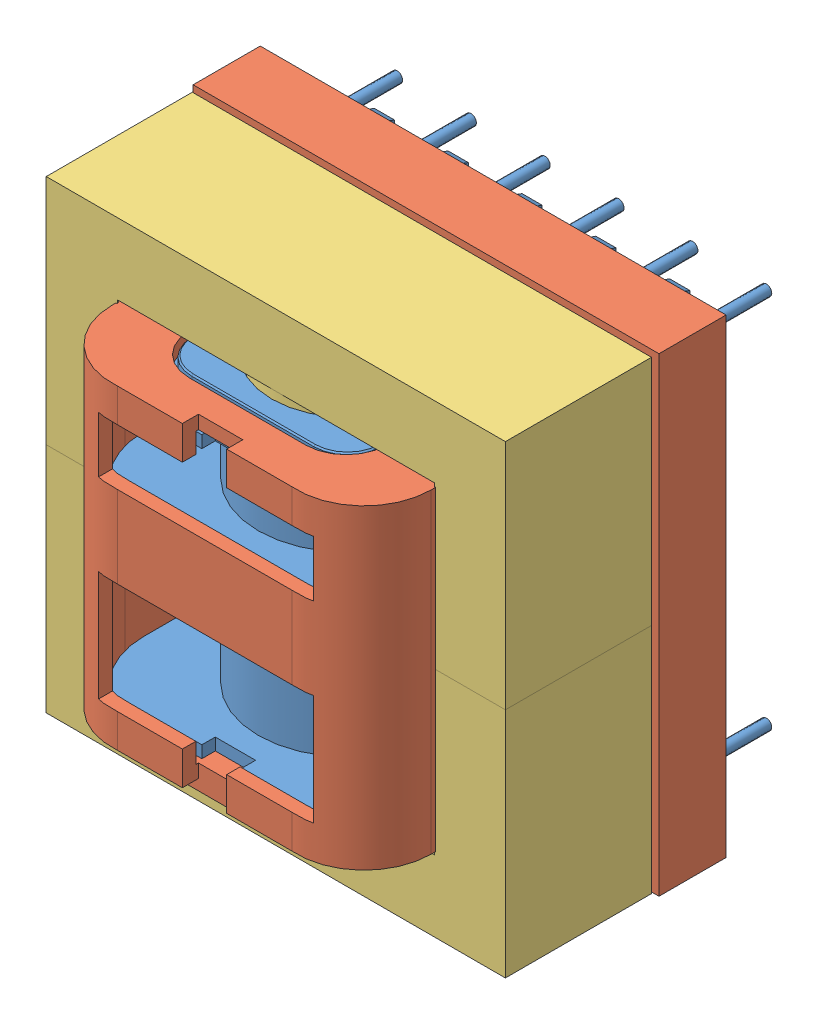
SolidWorks assembly XFMR.SLDASM, configuration Default (file format 6000). Lengths in mm.
Overall size (34.7 35 28.12).
4 component instances, 3 part files, 0 mates.
Components (placement in the parent):
- Bobbin_ETD34-1: Bobbin_ETD34.sldprt [Default] at origin size (32 32.5 26.8)
- Cover_ETD34-1: Cover_ETD34.sldprt [Default] at (0 0 -10.75) x (0 1 0) z (0 0 1) size (35 34.7 21.52)
- Core_ETD34-1: Core_ETD34.sldprt [Default] at (0 -17.3 0) x (-1 0 0) z (0 0 1) size (34.2 17.3 10.88)
- Core_ETD34-2: Core_ETD34.sldprt [Default] at (0 17.3 0) x (-1 0 0) z (0 0 -1) size (34.2 17.3 10.88)
